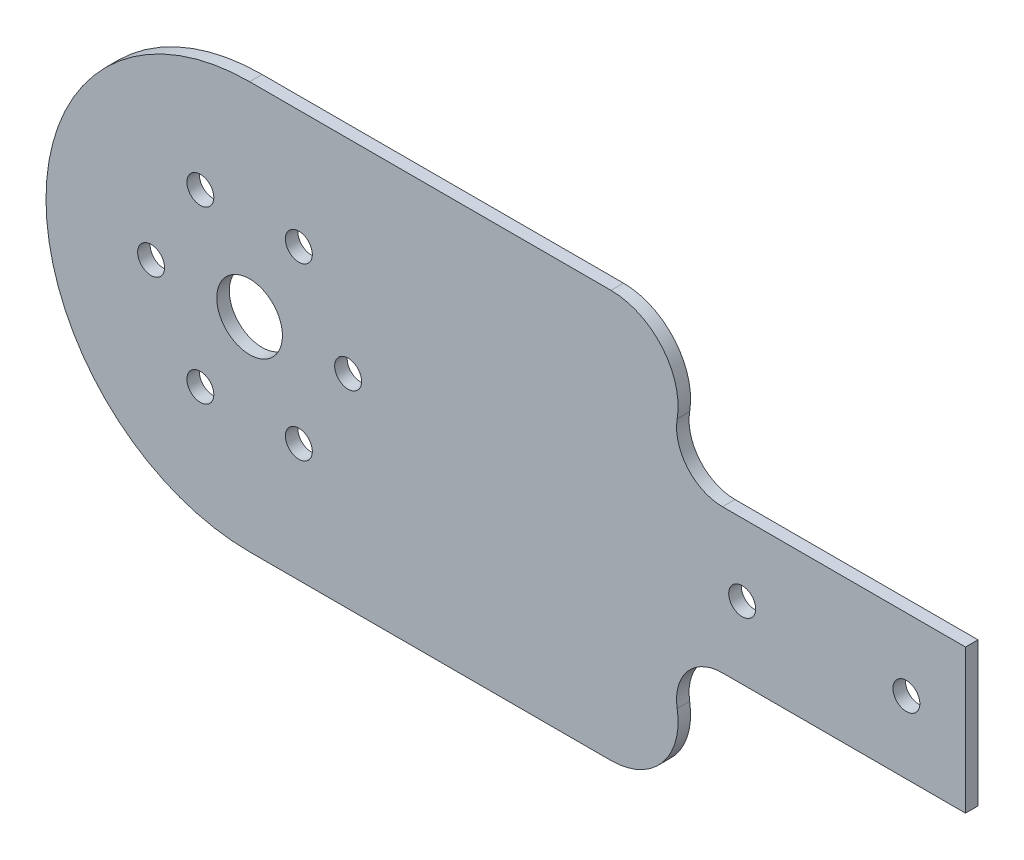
from build123d import *

# Parameters (mm, degrees)
BOSS_EXTRUDE1_DEPTH = 1.905
SKETCH2_R           = 2.05
CUT_EXTRUDE1_DEPTH  = 114.338559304
SKETCH3_R           = 5
CUT_EXTRUDE2_DEPTH  = 114.338559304


with BuildPart() as part:
    # Sketch1 → Boss-Extrude1 (new body)
    with BuildSketch(Plane(origin=(0, 0, 0), x_dir=(0, 1, 0), z_dir=(0, 0, 1))):
        with BuildLine():
            Line((-31, 0), (-31, -55.02))
            ThreePointArc((-31, -55.02), (-27.38533419, -62.819199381), (-19.097916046, -65.102184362))
            ThreePointArc((-19.097916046, -65.102184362), (-13.428005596, -66.664108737), (-10.955, -72))
            Line((-10.955, -72), (-10.955, -109))
            Line((-10.955, -109), (10.955, -109))
            Line((10.955, -109), (10.955, -72))
            ThreePointArc((10.955, -72), (13.428005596, -66.664108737), (19.097916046, -65.102184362))
            ThreePointArc((19.097916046, -65.102184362), (27.38533419, -62.819199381), (31, -55.02))
            Line((31, -55.02), (31, 0))
            ThreePointArc((31, 0), (0, 31), (-31, 0))
        make_face()
    extrude(amount=BOSS_EXTRUDE1_DEPTH)

    # Sketch2 → Cut-Extrude1 (cut, through all)
    with BuildSketch(Plane.XY.offset(1.905)):
        with Locations((-15, 0)):
            Circle(SKETCH2_R)
        with Locations((-7.5, 12.990381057)):
            Circle(SKETCH2_R)
        with Locations((7.5, 12.990381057)):
            Circle(SKETCH2_R)
        with Locations((15, 0)):
            Circle(SKETCH2_R)
        with Locations((7.5, -12.990381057)):
            Circle(SKETCH2_R)
        with Locations((-7.5, -12.990381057)):
            Circle(SKETCH2_R)
        with Locations((100, 0)):
            Circle(SKETCH2_R)
        with Locations((75, 0)):
            Circle(SKETCH2_R)
    extrude(amount=-CUT_EXTRUDE1_DEPTH, mode=Mode.SUBTRACT)

    # Sketch3 → Cut-Extrude2 (cut, through all)
    with BuildSketch(Plane.XY.offset(1.905)):
        Circle(SKETCH3_R)
    extrude(amount=-CUT_EXTRUDE2_DEPTH, mode=Mode.SUBTRACT)


solid = part.part
